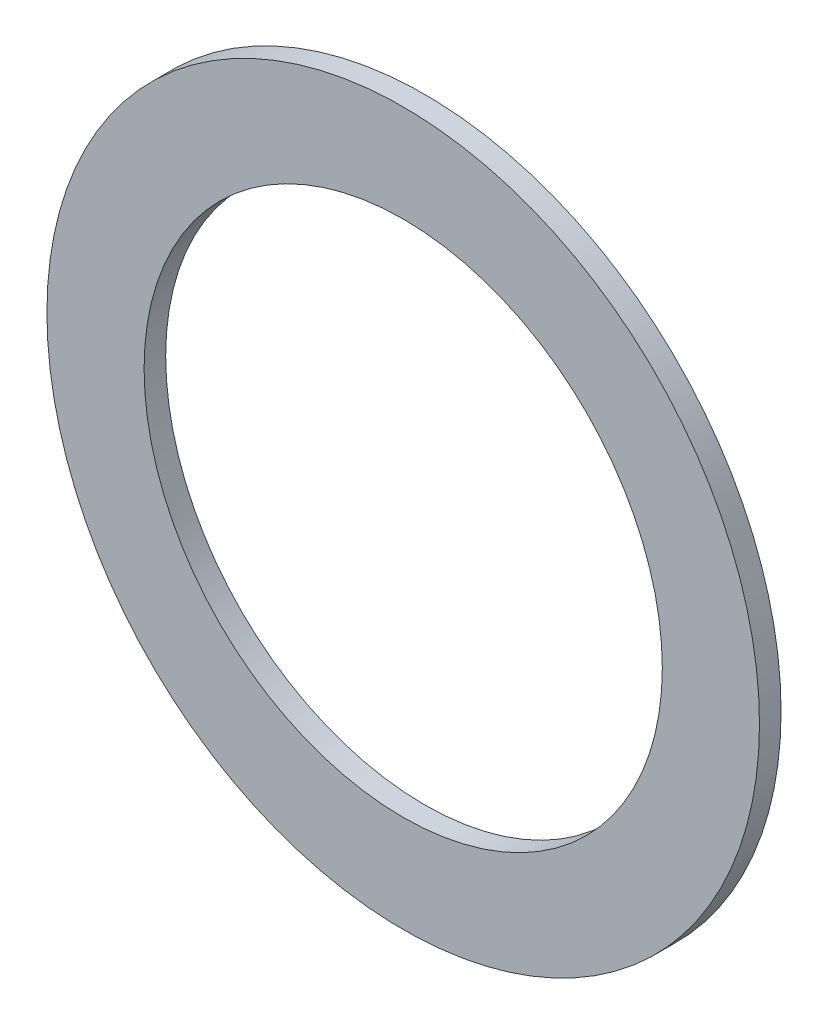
ISO-10303-21;
HEADER;
FILE_DESCRIPTION(('STEP AP214'),'2;1');
FILE_NAME('part.step','',(''),(''),'','','');
FILE_SCHEMA(('AUTOMOTIVE_DESIGN { 1 0 10303 214 1 1 1 1 }'));
ENDSEC;
DATA;
#1=APPLICATION_CONTEXT('core data for automotive mechanical design processes');
#2=APPLICATION_PROTOCOL_DEFINITION('international standard','automotive_design',2000,#1);
#3=PRODUCT_CONTEXT('',#1,'mechanical');
#4=PRODUCT('Part','Part','',(#3));
#5=PRODUCT_RELATED_PRODUCT_CATEGORY('part','',(#4));
#6=PRODUCT_DEFINITION_FORMATION('','',#4);
#7=PRODUCT_DEFINITION_CONTEXT('part definition',#1,'design');
#8=PRODUCT_DEFINITION('design','',#6,#7);
#9=PRODUCT_DEFINITION_SHAPE('','',#8);
#10=(LENGTH_UNIT() NAMED_UNIT(*) SI_UNIT(.MILLI.,.METRE.));
#11=(NAMED_UNIT(*) PLANE_ANGLE_UNIT() SI_UNIT($,.RADIAN.));
#12=(NAMED_UNIT(*) SI_UNIT($,.STERADIAN.) SOLID_ANGLE_UNIT());
#13=UNCERTAINTY_MEASURE_WITH_UNIT(LENGTH_MEASURE(1.E-05),#10,'distance_accuracy_value','');
#14=(GEOMETRIC_REPRESENTATION_CONTEXT(3) GLOBAL_UNCERTAINTY_ASSIGNED_CONTEXT((#13)) GLOBAL_UNIT_ASSIGNED_CONTEXT((#10,
#11,#12)) REPRESENTATION_CONTEXT('',''));
#15=CARTESIAN_POINT('',(0.,0.,0.));
#16=DIRECTION('',(0.,0.,1.));
#17=DIRECTION('',(1.,0.,0.));
#18=AXIS2_PLACEMENT_3D('',#15,#16,#17);
#19=CARTESIAN_POINT('',(0.,0.,1.));
#20=DIRECTION('',(0.,0.,1.));
#21=DIRECTION('',(1.,0.,0.));
#22=AXIS2_PLACEMENT_3D('',#19,#20,#21);
#23=PLANE('',#22);
#24=CARTESIAN_POINT('',(0.,0.,1.));
#25=DIRECTION('',(0.,0.,1.));
#26=DIRECTION('',(1.,0.,0.));
#27=AXIS2_PLACEMENT_3D('',#24,#25,#26);
#28=CIRCLE('',#27,16.5);
#29=CARTESIAN_POINT('',(16.5,0.,1.));
#30=VERTEX_POINT('',#29);
#31=EDGE_CURVE('E10',#30,#30,#28,.T.);
#32=ORIENTED_EDGE('',*,*,#31,.T.);
#33=EDGE_LOOP('',(#32));
#34=FACE_BOUND('',#33,.T.);
#35=CARTESIAN_POINT('',(0.,0.,1.));
#36=DIRECTION('',(0.,0.,1.));
#37=DIRECTION('',(1.,0.,0.));
#38=AXIS2_PLACEMENT_3D('',#35,#36,#37);
#39=CIRCLE('',#38,12.);
#40=CARTESIAN_POINT('',(12.,0.,1.));
#41=VERTEX_POINT('',#40);
#42=EDGE_CURVE('E50',#41,#41,#39,.T.);
#43=ORIENTED_EDGE('',*,*,#42,.F.);
#44=EDGE_LOOP('',(#43));
#45=FACE_BOUND('',#44,.T.);
#46=ADVANCED_FACE('F37',(#34,#45),#23,.T.);
#47=CARTESIAN_POINT('',(0.,0.,0.));
#48=DIRECTION('',(0.,0.,1.));
#49=DIRECTION('',(1.,0.,0.));
#50=AXIS2_PLACEMENT_3D('',#47,#48,#49);
#51=PLANE('',#50);
#52=CARTESIAN_POINT('',(0.,0.,0.));
#53=DIRECTION('',(0.,0.,1.));
#54=DIRECTION('',(1.,0.,0.));
#55=AXIS2_PLACEMENT_3D('',#52,#53,#54);
#56=CIRCLE('',#55,16.5);
#57=CARTESIAN_POINT('',(16.5,0.,0.));
#58=VERTEX_POINT('',#57);
#59=EDGE_CURVE('E41',#58,#58,#56,.T.);
#60=ORIENTED_EDGE('',*,*,#59,.F.);
#61=EDGE_LOOP('',(#60));
#62=FACE_BOUND('',#61,.T.);
#63=CARTESIAN_POINT('',(0.,0.,0.));
#64=DIRECTION('',(0.,0.,1.));
#65=DIRECTION('',(1.,0.,0.));
#66=AXIS2_PLACEMENT_3D('',#63,#64,#65);
#67=CIRCLE('',#66,12.);
#68=CARTESIAN_POINT('',(12.,0.,0.));
#69=VERTEX_POINT('',#68);
#70=EDGE_CURVE('E52',#69,#69,#67,.T.);
#71=ORIENTED_EDGE('',*,*,#70,.T.);
#72=EDGE_LOOP('',(#71));
#73=FACE_BOUND('',#72,.T.);
#74=ADVANCED_FACE('F64',(#62,#73),#51,.F.);
#75=CARTESIAN_POINT('',(0.,0.,1.));
#76=DIRECTION('',(0.,0.,-1.));
#77=DIRECTION('',(-1.,0.,0.));
#78=AXIS2_PLACEMENT_3D('',#75,#76,#77);
#79=CYLINDRICAL_SURFACE('',#78,16.5);
#80=ORIENTED_EDGE('',*,*,#31,.F.);
#81=EDGE_LOOP('',(#80));
#82=FACE_BOUND('',#81,.T.);
#83=ORIENTED_EDGE('',*,*,#59,.T.);
#84=EDGE_LOOP('',(#83));
#85=FACE_BOUND('',#84,.T.);
#86=ADVANCED_FACE('F39',(#82,#85),#79,.T.);
#87=CARTESIAN_POINT('',(0.,0.,1.));
#88=DIRECTION('',(0.,0.,-1.));
#89=DIRECTION('',(-1.,0.,0.));
#90=AXIS2_PLACEMENT_3D('',#87,#88,#89);
#91=CYLINDRICAL_SURFACE('',#90,12.);
#92=ORIENTED_EDGE('',*,*,#42,.T.);
#93=EDGE_LOOP('',(#92));
#94=FACE_BOUND('',#93,.T.);
#95=ORIENTED_EDGE('',*,*,#70,.F.);
#96=EDGE_LOOP('',(#95));
#97=FACE_BOUND('',#96,.T.);
#98=ADVANCED_FACE('F60',(#94,#97),#91,.F.);
#99=CLOSED_SHELL('',(#46,#74,#86,#98));
#100=MANIFOLD_SOLID_BREP('B2',#99);
#101=ADVANCED_BREP_SHAPE_REPRESENTATION('',(#18,#100),#14);
#102=SHAPE_DEFINITION_REPRESENTATION(#9,#101);
ENDSEC;
END-ISO-10303-21;
